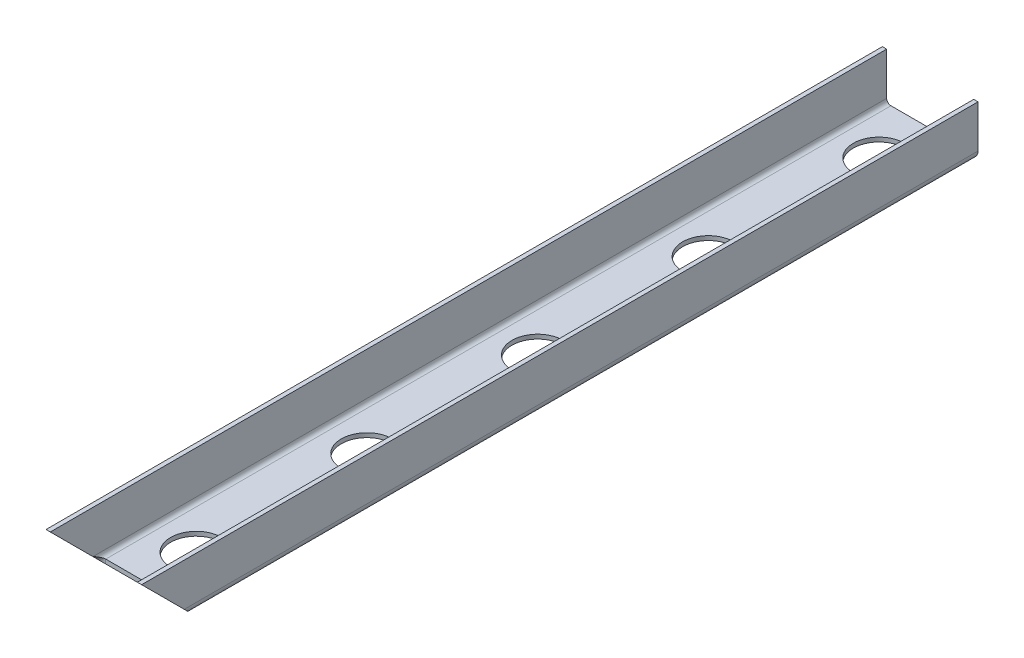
ISO-10303-21;
HEADER;
FILE_DESCRIPTION(('STEP AP214'),'2;1');
FILE_NAME('part.step','',(''),(''),'','','');
FILE_SCHEMA(('AUTOMOTIVE_DESIGN { 1 0 10303 214 1 1 1 1 }'));
ENDSEC;
DATA;
#1=APPLICATION_CONTEXT('core data for automotive mechanical design processes');
#2=APPLICATION_PROTOCOL_DEFINITION('international standard','automotive_design',2000,#1);
#3=PRODUCT_CONTEXT('',#1,'mechanical');
#4=PRODUCT('Part','Part','',(#3));
#5=PRODUCT_RELATED_PRODUCT_CATEGORY('part','',(#4));
#6=PRODUCT_DEFINITION_FORMATION('','',#4);
#7=PRODUCT_DEFINITION_CONTEXT('part definition',#1,'design');
#8=PRODUCT_DEFINITION('design','',#6,#7);
#9=PRODUCT_DEFINITION_SHAPE('','',#8);
#10=(LENGTH_UNIT() NAMED_UNIT(*) SI_UNIT(.MILLI.,.METRE.));
#11=(NAMED_UNIT(*) PLANE_ANGLE_UNIT() SI_UNIT($,.RADIAN.));
#12=(NAMED_UNIT(*) SI_UNIT($,.STERADIAN.) SOLID_ANGLE_UNIT());
#13=UNCERTAINTY_MEASURE_WITH_UNIT(LENGTH_MEASURE(1.E-05),#10,'distance_accuracy_value','');
#14=(GEOMETRIC_REPRESENTATION_CONTEXT(3) GLOBAL_UNCERTAINTY_ASSIGNED_CONTEXT((#13)) GLOBAL_UNIT_ASSIGNED_CONTEXT((#10,
#11,#12)) REPRESENTATION_CONTEXT('',''));
#15=CARTESIAN_POINT('',(0.,0.,0.));
#16=DIRECTION('',(0.,0.,1.));
#17=DIRECTION('',(1.,0.,0.));
#18=AXIS2_PLACEMENT_3D('',#15,#16,#17);
#19=CARTESIAN_POINT('',(28.,0.,245.));
#20=DIRECTION('',(-1.,0.,0.));
#21=DIRECTION('',(0.,0.,1.));
#22=AXIS2_PLACEMENT_3D('',#19,#20,#21);
#23=PLANE('',#22);
#24=DIRECTION('',(0.,-0.707106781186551,-0.707106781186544));
#25=VECTOR('',#24,1.);
#26=CARTESIAN_POINT('',(28.,13.7499999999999,231.25));
#27=LINE('',#26,#25);
#28=CARTESIAN_POINT('',(28.,27.5000000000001,245.));
#29=VERTEX_POINT('',#28);
#30=CARTESIAN_POINT('',(27.9999999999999,2.50000000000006,220.));
#31=VERTEX_POINT('',#30);
#32=EDGE_CURVE('E394',#29,#31,#27,.T.);
#33=ORIENTED_EDGE('',*,*,#32,.T.);
#34=DIRECTION('',(0.,0.,-1.));
#35=VECTOR('',#34,1.);
#36=CARTESIAN_POINT('',(28.,2.50000000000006,245.));
#37=LINE('',#36,#35);
#38=CARTESIAN_POINT('',(28.,2.50000000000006,-245.));
#39=VERTEX_POINT('',#38);
#40=EDGE_CURVE('E64',#31,#39,#37,.T.);
#41=ORIENTED_EDGE('',*,*,#40,.T.);
#42=DIRECTION('',(0.,1.,0.));
#43=VECTOR('',#42,1.);
#44=CARTESIAN_POINT('',(28.,0.,-245.));
#45=LINE('',#44,#43);
#46=CARTESIAN_POINT('',(28.,27.5,-245.));
#47=VERTEX_POINT('',#46);
#48=EDGE_CURVE('E388',#39,#47,#45,.T.);
#49=ORIENTED_EDGE('',*,*,#48,.T.);
#50=DIRECTION('',(0.,0.,-1.));
#51=VECTOR('',#50,1.);
#52=CARTESIAN_POINT('',(28.,27.5000000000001,245.));
#53=LINE('',#52,#51);
#54=EDGE_CURVE('E207',#29,#47,#53,.T.);
#55=ORIENTED_EDGE('',*,*,#54,.F.);
#56=EDGE_LOOP('',(#33,#41,#49,#55));
#57=FACE_BOUND('',#56,.T.);
#58=ADVANCED_FACE('F40',(#57),#23,.F.);
#59=CARTESIAN_POINT('',(25.5,0.,244.999999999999));
#60=DIRECTION('',(-1.,0.,0.));
#61=DIRECTION('',(0.,0.,1.));
#62=AXIS2_PLACEMENT_3D('',#59,#60,#61);
#63=PLANE('',#62);
#64=DIRECTION('',(0.,0.,-1.));
#65=VECTOR('',#64,1.);
#66=CARTESIAN_POINT('',(25.5,2.50000000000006,244.999999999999));
#67=LINE('',#66,#65);
#68=CARTESIAN_POINT('',(25.4999999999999,2.50000000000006,220.));
#69=VERTEX_POINT('',#68);
#70=CARTESIAN_POINT('',(25.5,2.50000000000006,-245.));
#71=VERTEX_POINT('',#70);
#72=EDGE_CURVE('E201',#69,#71,#67,.T.);
#73=ORIENTED_EDGE('',*,*,#72,.F.);
#74=DIRECTION('',(0.,-0.707106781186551,-0.707106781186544));
#75=VECTOR('',#74,1.);
#76=CARTESIAN_POINT('',(25.5,13.7499999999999,231.25));
#77=LINE('',#76,#75);
#78=CARTESIAN_POINT('',(25.5,27.5000000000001,244.999999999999));
#79=VERTEX_POINT('',#78);
#80=EDGE_CURVE('E397',#79,#69,#77,.T.);
#81=ORIENTED_EDGE('',*,*,#80,.F.);
#82=DIRECTION('',(0.,0.,-1.));
#83=VECTOR('',#82,1.);
#84=CARTESIAN_POINT('',(25.5,27.5000000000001,244.999999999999));
#85=LINE('',#84,#83);
#86=CARTESIAN_POINT('',(25.5,27.5,-245.));
#87=VERTEX_POINT('',#86);
#88=EDGE_CURVE('E204',#79,#87,#85,.T.);
#89=ORIENTED_EDGE('',*,*,#88,.T.);
#90=DIRECTION('',(0.,1.,0.));
#91=VECTOR('',#90,1.);
#92=CARTESIAN_POINT('',(25.5,0.,-245.));
#93=LINE('',#92,#91);
#94=EDGE_CURVE('E380',#71,#87,#93,.T.);
#95=ORIENTED_EDGE('',*,*,#94,.F.);
#96=EDGE_LOOP('',(#73,#81,#89,#95));
#97=FACE_BOUND('',#96,.T.);
#98=ADVANCED_FACE('F258',(#97),#63,.T.);
#99=CARTESIAN_POINT('',(23.,2.50000000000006,244.999999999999));
#100=DIRECTION('',(0.,0.,-1.));
#101=DIRECTION('',(-1.,0.,0.));
#102=AXIS2_PLACEMENT_3D('',#99,#100,#101);
#103=CYLINDRICAL_SURFACE('',#102,2.5);
#104=DIRECTION('',(0.,0.,-1.));
#105=VECTOR('',#104,1.);
#106=CARTESIAN_POINT('',(23.,0.,244.999999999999));
#107=LINE('',#106,#105);
#108=CARTESIAN_POINT('',(23.,0.,215.));
#109=VERTEX_POINT('',#108);
#110=CARTESIAN_POINT('',(23.,0.,-245.));
#111=VERTEX_POINT('',#110);
#112=EDGE_CURVE('E198',#109,#111,#107,.T.);
#113=ORIENTED_EDGE('',*,*,#112,.F.);
#114=CARTESIAN_POINT('',(22.9999999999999,2.50000000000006,220.));
#115=DIRECTION('',(0.,0.894427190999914,-0.447213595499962));
#116=DIRECTION('',(0.,-0.447213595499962,-0.894427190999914));
#117=AXIS2_PLACEMENT_3D('',#114,#115,#116);
#118=ELLIPSE('',#117,5.59016994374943,2.5);
#119=EDGE_CURVE('E139',#69,#109,#118,.T.);
#120=ORIENTED_EDGE('',*,*,#119,.F.);
#121=ORIENTED_EDGE('',*,*,#72,.T.);
#122=CARTESIAN_POINT('',(23.,2.50000000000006,-245.));
#123=DIRECTION('',(0.,0.,-1.));
#124=DIRECTION('',(-1.,0.,0.));
#125=AXIS2_PLACEMENT_3D('',#122,#123,#124);
#126=CIRCLE('',#125,2.5);
#127=EDGE_CURVE('E376',#111,#71,#126,.F.);
#128=ORIENTED_EDGE('',*,*,#127,.F.);
#129=EDGE_LOOP('',(#113,#120,#121,#128));
#130=FACE_BOUND('',#129,.T.);
#131=ADVANCED_FACE('F248',(#130),#103,.F.);
#132=CARTESIAN_POINT('',(-25.5,3.33066907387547E-13,245.));
#133=DIRECTION('',(0.,1.,0.));
#134=DIRECTION('',(-1.,0.,0.));
#135=AXIS2_PLACEMENT_3D('',#132,#133,#134);
#136=PLANE('',#135);
#137=CARTESIAN_POINT('',(0.,0.,-115.));
#138=DIRECTION('',(0.,1.,0.));
#139=DIRECTION('',(-1.,0.,0.));
#140=AXIS2_PLACEMENT_3D('',#137,#138,#139);
#141=CIRCLE('',#140,15.);
#142=CARTESIAN_POINT('',(-15.0000000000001,0.,-115.));
#143=VERTEX_POINT('',#142);
#144=EDGE_CURVE('E430',#143,#143,#141,.T.);
#145=ORIENTED_EDGE('',*,*,#144,.F.);
#146=EDGE_LOOP('',(#145));
#147=FACE_BOUND('',#146,.T.);
#148=CARTESIAN_POINT('',(0.,0.,-215.));
#149=DIRECTION('',(0.,1.,0.));
#150=DIRECTION('',(-1.,0.,0.));
#151=AXIS2_PLACEMENT_3D('',#148,#149,#150);
#152=CIRCLE('',#151,15.);
#153=CARTESIAN_POINT('',(-15.,0.,-215.));
#154=VERTEX_POINT('',#153);
#155=EDGE_CURVE('E423',#154,#154,#152,.T.);
#156=ORIENTED_EDGE('',*,*,#155,.F.);
#157=EDGE_LOOP('',(#156));
#158=FACE_BOUND('',#157,.T.);
#159=DIRECTION('',(0.,0.,-1.));
#160=VECTOR('',#159,1.);
#161=CARTESIAN_POINT('',(-23.,3.33066907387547E-13,245.));
#162=LINE('',#161,#160);
#163=CARTESIAN_POINT('',(-23.,3.33066907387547E-13,215.));
#164=VERTEX_POINT('',#163);
#165=CARTESIAN_POINT('',(-23.,3.33066907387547E-13,-245.));
#166=VERTEX_POINT('',#165);
#167=EDGE_CURVE('E195',#164,#166,#162,.T.);
#168=ORIENTED_EDGE('',*,*,#167,.F.);
#169=DIRECTION('',(-1.,0.,0.));
#170=VECTOR('',#169,1.);
#171=CARTESIAN_POINT('',(-25.5,3.33066907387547E-13,215.));
#172=LINE('',#171,#170);
#173=EDGE_CURVE('E144',#164,#109,#172,.F.);
#174=ORIENTED_EDGE('',*,*,#173,.T.);
#175=ORIENTED_EDGE('',*,*,#112,.T.);
#176=DIRECTION('',(1.,0.,0.));
#177=VECTOR('',#176,1.);
#178=CARTESIAN_POINT('',(-25.5,3.33066907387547E-13,-245.));
#179=LINE('',#178,#177);
#180=EDGE_CURVE('E372',#166,#111,#179,.T.);
#181=ORIENTED_EDGE('',*,*,#180,.F.);
#182=EDGE_LOOP('',(#168,#174,#175,#181));
#183=FACE_BOUND('',#182,.T.);
#184=CARTESIAN_POINT('',(0.,0.,-14.9999999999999));
#185=DIRECTION('',(0.,1.,0.));
#186=DIRECTION('',(-1.,0.,0.));
#187=AXIS2_PLACEMENT_3D('',#184,#185,#186);
#188=CIRCLE('',#187,15.);
#189=CARTESIAN_POINT('',(-15.,0.,-14.9999999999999));
#190=VERTEX_POINT('',#189);
#191=EDGE_CURVE('E224',#190,#190,#188,.T.);
#192=ORIENTED_EDGE('',*,*,#191,.F.);
#193=EDGE_LOOP('',(#192));
#194=FACE_BOUND('',#193,.T.);
#195=CARTESIAN_POINT('',(0.,0.,85.0000000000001));
#196=DIRECTION('',(0.,1.,0.));
#197=DIRECTION('',(-1.,0.,0.));
#198=AXIS2_PLACEMENT_3D('',#195,#196,#197);
#199=CIRCLE('',#198,15.);
#200=CARTESIAN_POINT('',(-15.,0.,85.0000000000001));
#201=VERTEX_POINT('',#200);
#202=EDGE_CURVE('E232',#201,#201,#199,.T.);
#203=ORIENTED_EDGE('',*,*,#202,.F.);
#204=EDGE_LOOP('',(#203));
#205=FACE_BOUND('',#204,.T.);
#206=CARTESIAN_POINT('',(0.,0.,185.));
#207=DIRECTION('',(0.,1.,0.));
#208=DIRECTION('',(-1.,0.,0.));
#209=AXIS2_PLACEMENT_3D('',#206,#207,#208);
#210=CIRCLE('',#209,15.);
#211=CARTESIAN_POINT('',(-15.,0.,185.));
#212=VERTEX_POINT('',#211);
#213=EDGE_CURVE('E49',#212,#212,#210,.T.);
#214=ORIENTED_EDGE('',*,*,#213,.F.);
#215=EDGE_LOOP('',(#214));
#216=FACE_BOUND('',#215,.T.);
#217=ADVANCED_FACE('F245',(#147,#158,#183,#194,#205,#216),#136,.T.);
#218=CARTESIAN_POINT('',(-23.,2.50000000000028,245.));
#219=DIRECTION('',(0.,0.,-1.));
#220=DIRECTION('',(-1.,0.,0.));
#221=AXIS2_PLACEMENT_3D('',#218,#219,#220);
#222=CYLINDRICAL_SURFACE('',#221,2.5);
#223=DIRECTION('',(0.,0.,-1.));
#224=VECTOR('',#223,1.);
#225=CARTESIAN_POINT('',(-25.5,2.50000000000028,245.));
#226=LINE('',#225,#224);
#227=CARTESIAN_POINT('',(-25.5,2.50000000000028,220.));
#228=VERTEX_POINT('',#227);
#229=CARTESIAN_POINT('',(-25.5,2.50000000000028,-245.));
#230=VERTEX_POINT('',#229);
#231=EDGE_CURVE('E192',#228,#230,#226,.T.);
#232=ORIENTED_EDGE('',*,*,#231,.F.);
#233=CARTESIAN_POINT('',(-23.,2.50000000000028,220.));
#234=DIRECTION('',(0.,0.894427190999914,-0.447213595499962));
#235=DIRECTION('',(0.,-0.447213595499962,-0.894427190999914));
#236=AXIS2_PLACEMENT_3D('',#233,#234,#235);
#237=ELLIPSE('',#236,5.59016994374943,2.5);
#238=EDGE_CURVE('E412',#164,#228,#237,.T.);
#239=ORIENTED_EDGE('',*,*,#238,.F.);
#240=ORIENTED_EDGE('',*,*,#167,.T.);
#241=CARTESIAN_POINT('',(-23.,2.50000000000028,-245.));
#242=DIRECTION('',(0.,0.,-1.));
#243=DIRECTION('',(-1.,0.,0.));
#244=AXIS2_PLACEMENT_3D('',#241,#242,#243);
#245=CIRCLE('',#244,2.5);
#246=EDGE_CURVE('E368',#230,#166,#245,.F.);
#247=ORIENTED_EDGE('',*,*,#246,.F.);
#248=EDGE_LOOP('',(#232,#239,#240,#247));
#249=FACE_BOUND('',#248,.T.);
#250=ADVANCED_FACE('F247',(#249),#222,.F.);
#251=CARTESIAN_POINT('',(-25.5,27.5000000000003,245.));
#252=DIRECTION('',(1.,0.,0.));
#253=DIRECTION('',(0.,1.,0.));
#254=AXIS2_PLACEMENT_3D('',#251,#252,#253);
#255=PLANE('',#254);
#256=DIRECTION('',(0.,0.,-1.));
#257=VECTOR('',#256,1.);
#258=CARTESIAN_POINT('',(-25.5,27.5000000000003,245.));
#259=LINE('',#258,#257);
#260=CARTESIAN_POINT('',(-25.5,27.5000000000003,245.));
#261=VERTEX_POINT('',#260);
#262=CARTESIAN_POINT('',(-25.5,27.5000000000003,-245.));
#263=VERTEX_POINT('',#262);
#264=EDGE_CURVE('E189',#261,#263,#259,.T.);
#265=ORIENTED_EDGE('',*,*,#264,.F.);
#266=DIRECTION('',(0.,0.707106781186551,0.707106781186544));
#267=VECTOR('',#266,1.);
#268=CARTESIAN_POINT('',(-25.5,-2.49999999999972,215.));
#269=LINE('',#268,#267);
#270=EDGE_CURVE('E56',#228,#261,#269,.T.);
#271=ORIENTED_EDGE('',*,*,#270,.F.);
#272=ORIENTED_EDGE('',*,*,#231,.T.);
#273=DIRECTION('',(0.,-1.,0.));
#274=VECTOR('',#273,1.);
#275=CARTESIAN_POINT('',(-25.5,27.5000000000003,-245.));
#276=LINE('',#275,#274);
#277=EDGE_CURVE('E337',#263,#230,#276,.T.);
#278=ORIENTED_EDGE('',*,*,#277,.F.);
#279=EDGE_LOOP('',(#265,#271,#272,#278));
#280=FACE_BOUND('',#279,.T.);
#281=ADVANCED_FACE('F255',(#280),#255,.T.);
#282=CARTESIAN_POINT('',(-28.,27.5000000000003,245.));
#283=DIRECTION('',(1.,0.,0.));
#284=DIRECTION('',(0.,1.,0.));
#285=AXIS2_PLACEMENT_3D('',#282,#283,#284);
#286=PLANE('',#285);
#287=DIRECTION('',(0.,0.707106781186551,0.707106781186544));
#288=VECTOR('',#287,1.);
#289=CARTESIAN_POINT('',(-28.,-2.49999999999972,215.));
#290=LINE('',#289,#288);
#291=CARTESIAN_POINT('',(-28.,2.50000000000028,220.));
#292=VERTEX_POINT('',#291);
#293=CARTESIAN_POINT('',(-28.,27.5000000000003,245.));
#294=VERTEX_POINT('',#293);
#295=EDGE_CURVE('E409',#292,#294,#290,.T.);
#296=ORIENTED_EDGE('',*,*,#295,.T.);
#297=DIRECTION('',(0.,0.,-1.));
#298=VECTOR('',#297,1.);
#299=CARTESIAN_POINT('',(-28.,27.5000000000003,245.));
#300=LINE('',#299,#298);
#301=CARTESIAN_POINT('',(-28.,27.5000000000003,-245.));
#302=VERTEX_POINT('',#301);
#303=EDGE_CURVE('E186',#294,#302,#300,.T.);
#304=ORIENTED_EDGE('',*,*,#303,.T.);
#305=DIRECTION('',(0.,-1.,0.));
#306=VECTOR('',#305,1.);
#307=CARTESIAN_POINT('',(-28.,27.5000000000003,-245.));
#308=LINE('',#307,#306);
#309=CARTESIAN_POINT('',(-28.,2.50000000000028,-245.));
#310=VERTEX_POINT('',#309);
#311=EDGE_CURVE('E359',#302,#310,#308,.T.);
#312=ORIENTED_EDGE('',*,*,#311,.T.);
#313=DIRECTION('',(0.,0.,-1.));
#314=VECTOR('',#313,1.);
#315=CARTESIAN_POINT('',(-28.,2.50000000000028,245.));
#316=LINE('',#315,#314);
#317=EDGE_CURVE('E177',#292,#310,#316,.T.);
#318=ORIENTED_EDGE('',*,*,#317,.F.);
#319=EDGE_LOOP('',(#296,#304,#312,#318));
#320=FACE_BOUND('',#319,.T.);
#321=ADVANCED_FACE('F314',(#320),#286,.F.);
#322=CARTESIAN_POINT('',(-23.,2.50000000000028,245.));
#323=DIRECTION('',(0.,0.,-1.));
#324=DIRECTION('',(-1.,0.,0.));
#325=AXIS2_PLACEMENT_3D('',#322,#323,#324);
#326=CYLINDRICAL_SURFACE('',#325,5.);
#327=CARTESIAN_POINT('',(-23.,2.50000000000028,220.));
#328=DIRECTION('',(0.,0.707106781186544,-0.707106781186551));
#329=DIRECTION('',(0.,-0.707106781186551,-0.707106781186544));
#330=AXIS2_PLACEMENT_3D('',#327,#328,#329);
#331=ELLIPSE('',#330,7.07106781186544,5.);
#332=CARTESIAN_POINT('',(-23.,-2.49999999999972,215.));
#333=VERTEX_POINT('',#332);
#334=EDGE_CURVE('E415',#333,#292,#331,.T.);
#335=ORIENTED_EDGE('',*,*,#334,.T.);
#336=ORIENTED_EDGE('',*,*,#317,.T.);
#337=CARTESIAN_POINT('',(-23.,2.50000000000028,-245.));
#338=DIRECTION('',(0.,0.,1.));
#339=DIRECTION('',(1.,0.,0.));
#340=AXIS2_PLACEMENT_3D('',#337,#338,#339);
#341=CIRCLE('',#340,5.);
#342=CARTESIAN_POINT('',(-23.,-2.49999999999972,-245.));
#343=VERTEX_POINT('',#342);
#344=EDGE_CURVE('E355',#310,#343,#341,.T.);
#345=ORIENTED_EDGE('',*,*,#344,.T.);
#346=DIRECTION('',(0.,0.,-1.));
#347=VECTOR('',#346,1.);
#348=CARTESIAN_POINT('',(-23.,-2.49999999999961,245.));
#349=LINE('',#348,#347);
#350=EDGE_CURVE('E172',#333,#343,#349,.T.);
#351=ORIENTED_EDGE('',*,*,#350,.F.);
#352=EDGE_LOOP('',(#335,#336,#345,#351));
#353=FACE_BOUND('',#352,.T.);
#354=ADVANCED_FACE('F305',(#353),#326,.T.);
#355=CARTESIAN_POINT('',(-25.5,-2.49999999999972,245.));
#356=DIRECTION('',(0.,1.,0.));
#357=DIRECTION('',(-1.,0.,0.));
#358=AXIS2_PLACEMENT_3D('',#355,#356,#357);
#359=PLANE('',#358);
#360=CARTESIAN_POINT('',(0.,-2.50000000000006,-115.));
#361=DIRECTION('',(0.,1.,0.));
#362=DIRECTION('',(-1.,0.,0.));
#363=AXIS2_PLACEMENT_3D('',#360,#361,#362);
#364=CIRCLE('',#363,15.);
#365=CARTESIAN_POINT('',(-15.,-2.50000000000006,-115.));
#366=VERTEX_POINT('',#365);
#367=EDGE_CURVE('E427',#366,#366,#364,.F.);
#368=ORIENTED_EDGE('',*,*,#367,.F.);
#369=EDGE_LOOP('',(#368));
#370=FACE_BOUND('',#369,.T.);
#371=CARTESIAN_POINT('',(0.,-2.49999999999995,-215.));
#372=DIRECTION('',(0.,1.,0.));
#373=DIRECTION('',(-1.,0.,0.));
#374=AXIS2_PLACEMENT_3D('',#371,#372,#373);
#375=CIRCLE('',#374,15.);
#376=CARTESIAN_POINT('',(-15.,-2.49999999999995,-215.));
#377=VERTEX_POINT('',#376);
#378=EDGE_CURVE('E163',#377,#377,#375,.F.);
#379=ORIENTED_EDGE('',*,*,#378,.F.);
#380=EDGE_LOOP('',(#379));
#381=FACE_BOUND('',#380,.T.);
#382=DIRECTION('',(1.,0.,0.));
#383=VECTOR('',#382,1.);
#384=CARTESIAN_POINT('',(-28.,-2.49999999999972,215.));
#385=LINE('',#384,#383);
#386=CARTESIAN_POINT('',(23.,-2.49999999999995,215.));
#387=VERTEX_POINT('',#386);
#388=EDGE_CURVE('E147',#333,#387,#385,.T.);
#389=ORIENTED_EDGE('',*,*,#388,.F.);
#390=ORIENTED_EDGE('',*,*,#350,.T.);
#391=DIRECTION('',(1.,0.,0.));
#392=VECTOR('',#391,1.);
#393=CARTESIAN_POINT('',(-25.5,-2.49999999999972,-245.));
#394=LINE('',#393,#392);
#395=CARTESIAN_POINT('',(23.,-2.49999999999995,-245.));
#396=VERTEX_POINT('',#395);
#397=EDGE_CURVE('E169',#343,#396,#394,.T.);
#398=ORIENTED_EDGE('',*,*,#397,.T.);
#399=DIRECTION('',(0.,0.,-1.));
#400=VECTOR('',#399,1.);
#401=CARTESIAN_POINT('',(23.,-2.49999999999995,244.999999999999));
#402=LINE('',#401,#400);
#403=EDGE_CURVE('E160',#387,#396,#402,.T.);
#404=ORIENTED_EDGE('',*,*,#403,.F.);
#405=EDGE_LOOP('',(#389,#390,#398,#404));
#406=FACE_BOUND('',#405,.T.);
#407=CARTESIAN_POINT('',(0.,-2.49999999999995,-14.9999999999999));
#408=DIRECTION('',(0.,1.,0.));
#409=DIRECTION('',(-1.,0.,0.));
#410=AXIS2_PLACEMENT_3D('',#407,#408,#409);
#411=CIRCLE('',#410,15.);
#412=CARTESIAN_POINT('',(-15.,-2.49999999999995,-14.9999999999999));
#413=VERTEX_POINT('',#412);
#414=EDGE_CURVE('E228',#413,#413,#411,.F.);
#415=ORIENTED_EDGE('',*,*,#414,.F.);
#416=EDGE_LOOP('',(#415));
#417=FACE_BOUND('',#416,.T.);
#418=CARTESIAN_POINT('',(0.,-2.49999999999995,85.0000000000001));
#419=DIRECTION('',(0.,1.,0.));
#420=DIRECTION('',(-1.,0.,0.));
#421=AXIS2_PLACEMENT_3D('',#418,#419,#420);
#422=CIRCLE('',#421,15.);
#423=CARTESIAN_POINT('',(-15.,-2.49999999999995,85.0000000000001));
#424=VERTEX_POINT('',#423);
#425=EDGE_CURVE('E236',#424,#424,#422,.F.);
#426=ORIENTED_EDGE('',*,*,#425,.F.);
#427=EDGE_LOOP('',(#426));
#428=FACE_BOUND('',#427,.T.);
#429=CARTESIAN_POINT('',(0.,-2.49999999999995,185.));
#430=DIRECTION('',(0.,1.,0.));
#431=DIRECTION('',(-1.,0.,0.));
#432=AXIS2_PLACEMENT_3D('',#429,#430,#431);
#433=CIRCLE('',#432,15.);
#434=CARTESIAN_POINT('',(-15.,-2.49999999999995,185.));
#435=VERTEX_POINT('',#434);
#436=EDGE_CURVE('E11',#435,#435,#433,.F.);
#437=ORIENTED_EDGE('',*,*,#436,.F.);
#438=EDGE_LOOP('',(#437));
#439=FACE_BOUND('',#438,.T.);
#440=ADVANCED_FACE('F166',(#370,#381,#406,#417,#428,#439),#359,.F.);
#441=CARTESIAN_POINT('',(23.,2.50000000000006,244.999999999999));
#442=DIRECTION('',(0.,0.,-1.));
#443=DIRECTION('',(-1.,0.,0.));
#444=AXIS2_PLACEMENT_3D('',#441,#442,#443);
#445=CYLINDRICAL_SURFACE('',#444,5.);
#446=CARTESIAN_POINT('',(22.9999999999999,2.50000000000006,220.));
#447=DIRECTION('',(0.,0.707106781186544,-0.707106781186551));
#448=DIRECTION('',(0.,-0.707106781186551,-0.707106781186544));
#449=AXIS2_PLACEMENT_3D('',#446,#447,#448);
#450=ELLIPSE('',#449,7.07106781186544,5.);
#451=EDGE_CURVE('E136',#31,#387,#450,.T.);
#452=ORIENTED_EDGE('',*,*,#451,.T.);
#453=ORIENTED_EDGE('',*,*,#403,.T.);
#454=CARTESIAN_POINT('',(23.,2.50000000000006,-245.));
#455=DIRECTION('',(0.,0.,1.));
#456=DIRECTION('',(1.,0.,0.));
#457=AXIS2_PLACEMENT_3D('',#454,#455,#456);
#458=CIRCLE('',#457,5.);
#459=EDGE_CURVE('E348',#396,#39,#458,.T.);
#460=ORIENTED_EDGE('',*,*,#459,.T.);
#461=ORIENTED_EDGE('',*,*,#40,.F.);
#462=EDGE_LOOP('',(#452,#453,#460,#461));
#463=FACE_BOUND('',#462,.T.);
#464=ADVANCED_FACE('F158',(#463),#445,.T.);
#465=CARTESIAN_POINT('',(-25.5,2.50000000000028,-245.));
#466=DIRECTION('',(0.,0.,-1.));
#467=DIRECTION('',(-1.,0.,0.));
#468=AXIS2_PLACEMENT_3D('',#465,#466,#467);
#469=PLANE('',#468);
#470=DIRECTION('',(-1.,0.,0.));
#471=VECTOR('',#470,1.);
#472=CARTESIAN_POINT('',(-25.5,2.50000000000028,-245.));
#473=LINE('',#472,#471);
#474=EDGE_CURVE('E221',#230,#310,#473,.T.);
#475=ORIENTED_EDGE('',*,*,#474,.F.);
#476=ORIENTED_EDGE('',*,*,#246,.T.);
#477=DIRECTION('',(0.,1.,0.));
#478=VECTOR('',#477,1.);
#479=CARTESIAN_POINT('',(-23.,-2.49999999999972,-245.));
#480=LINE('',#479,#478);
#481=EDGE_CURVE('E217',#343,#166,#480,.T.);
#482=ORIENTED_EDGE('',*,*,#481,.F.);
#483=ORIENTED_EDGE('',*,*,#344,.F.);
#484=EDGE_LOOP('',(#475,#476,#482,#483));
#485=FACE_BOUND('',#484,.T.);
#486=ADVANCED_FACE('F284',(#485),#469,.T.);
#487=CARTESIAN_POINT('',(-23.,-2.49999999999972,-245.));
#488=DIRECTION('',(0.,0.,-1.));
#489=DIRECTION('',(-1.,0.,0.));
#490=AXIS2_PLACEMENT_3D('',#487,#488,#489);
#491=PLANE('',#490);
#492=ORIENTED_EDGE('',*,*,#277,.T.);
#493=ORIENTED_EDGE('',*,*,#474,.T.);
#494=ORIENTED_EDGE('',*,*,#311,.F.);
#495=DIRECTION('',(1.,0.,0.));
#496=VECTOR('',#495,1.);
#497=CARTESIAN_POINT('',(-28.,27.5000000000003,-245.));
#498=LINE('',#497,#496);
#499=EDGE_CURVE('E363',#302,#263,#498,.T.);
#500=ORIENTED_EDGE('',*,*,#499,.T.);
#501=EDGE_LOOP('',(#492,#493,#494,#500));
#502=FACE_BOUND('',#501,.T.);
#503=ADVANCED_FACE('F280',(#502),#491,.T.);
#504=CARTESIAN_POINT('',(23.,0.,-245.));
#505=DIRECTION('',(0.,0.,-1.));
#506=DIRECTION('',(-1.,0.,0.));
#507=AXIS2_PLACEMENT_3D('',#504,#505,#506);
#508=PLANE('',#507);
#509=DIRECTION('',(0.,-1.,0.));
#510=VECTOR('',#509,1.);
#511=CARTESIAN_POINT('',(23.,0.,-245.));
#512=LINE('',#511,#510);
#513=EDGE_CURVE('E214',#111,#396,#512,.T.);
#514=ORIENTED_EDGE('',*,*,#513,.F.);
#515=ORIENTED_EDGE('',*,*,#127,.T.);
#516=DIRECTION('',(-1.,0.,0.));
#517=VECTOR('',#516,1.);
#518=CARTESIAN_POINT('',(28.,2.50000000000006,-245.));
#519=LINE('',#518,#517);
#520=EDGE_CURVE('E210',#39,#71,#519,.T.);
#521=ORIENTED_EDGE('',*,*,#520,.F.);
#522=ORIENTED_EDGE('',*,*,#459,.F.);
#523=EDGE_LOOP('',(#514,#515,#521,#522));
#524=FACE_BOUND('',#523,.T.);
#525=ADVANCED_FACE('F276',(#524),#508,.T.);
#526=CARTESIAN_POINT('',(28.,2.50000000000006,-245.));
#527=DIRECTION('',(0.,0.,-1.));
#528=DIRECTION('',(-1.,0.,0.));
#529=AXIS2_PLACEMENT_3D('',#526,#527,#528);
#530=PLANE('',#529);
#531=ORIENTED_EDGE('',*,*,#180,.T.);
#532=ORIENTED_EDGE('',*,*,#513,.T.);
#533=ORIENTED_EDGE('',*,*,#397,.F.);
#534=ORIENTED_EDGE('',*,*,#481,.T.);
#535=EDGE_LOOP('',(#531,#532,#533,#534));
#536=FACE_BOUND('',#535,.T.);
#537=ADVANCED_FACE('F273',(#536),#530,.T.);
#538=CARTESIAN_POINT('',(25.5,27.5000000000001,244.999999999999));
#539=DIRECTION('',(0.,1.,0.));
#540=DIRECTION('',(0.,0.,1.));
#541=AXIS2_PLACEMENT_3D('',#538,#539,#540);
#542=PLANE('',#541);
#543=DIRECTION('',(1.,0.,0.));
#544=VECTOR('',#543,1.);
#545=CARTESIAN_POINT('',(25.5,27.5,-245.));
#546=LINE('',#545,#544);
#547=EDGE_CURVE('E384',#87,#47,#546,.T.);
#548=ORIENTED_EDGE('',*,*,#547,.F.);
#549=ORIENTED_EDGE('',*,*,#88,.F.);
#550=DIRECTION('',(1.,0.,0.));
#551=VECTOR('',#550,1.);
#552=CARTESIAN_POINT('',(25.5,27.5000000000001,244.999999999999));
#553=LINE('',#552,#551);
#554=EDGE_CURVE('E344',#79,#29,#553,.T.);
#555=ORIENTED_EDGE('',*,*,#554,.T.);
#556=ORIENTED_EDGE('',*,*,#54,.T.);
#557=EDGE_LOOP('',(#548,#549,#555,#556));
#558=FACE_BOUND('',#557,.T.);
#559=ADVANCED_FACE('F272',(#558),#542,.T.);
#560=CARTESIAN_POINT('',(-28.,27.5000000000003,245.));
#561=DIRECTION('',(0.,1.,0.));
#562=DIRECTION('',(0.,0.,1.));
#563=AXIS2_PLACEMENT_3D('',#560,#561,#562);
#564=PLANE('',#563);
#565=ORIENTED_EDGE('',*,*,#499,.F.);
#566=ORIENTED_EDGE('',*,*,#303,.F.);
#567=DIRECTION('',(1.,0.,0.));
#568=VECTOR('',#567,1.);
#569=CARTESIAN_POINT('',(-28.,27.5000000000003,245.));
#570=LINE('',#569,#568);
#571=EDGE_CURVE('E180',#294,#261,#570,.T.);
#572=ORIENTED_EDGE('',*,*,#571,.T.);
#573=ORIENTED_EDGE('',*,*,#264,.T.);
#574=EDGE_LOOP('',(#565,#566,#572,#573));
#575=FACE_BOUND('',#574,.T.);
#576=ADVANCED_FACE('F324',(#575),#564,.T.);
#577=CARTESIAN_POINT('',(23.,2.50000000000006,-245.));
#578=DIRECTION('',(0.,0.,-1.));
#579=DIRECTION('',(-1.,0.,0.));
#580=AXIS2_PLACEMENT_3D('',#577,#578,#579);
#581=PLANE('',#580);
#582=ORIENTED_EDGE('',*,*,#48,.F.);
#583=ORIENTED_EDGE('',*,*,#520,.T.);
#584=ORIENTED_EDGE('',*,*,#94,.T.);
#585=ORIENTED_EDGE('',*,*,#547,.T.);
#586=EDGE_LOOP('',(#582,#583,#584,#585));
#587=FACE_BOUND('',#586,.T.);
#588=ADVANCED_FACE('F327',(#587),#581,.T.);
#589=CARTESIAN_POINT('',(25.5,13.7499999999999,231.25));
#590=DIRECTION('',(0.,0.707106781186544,-0.707106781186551));
#591=DIRECTION('',(0.,-0.707106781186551,-0.707106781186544));
#592=AXIS2_PLACEMENT_3D('',#589,#590,#591);
#593=PLANE('',#592);
#594=ORIENTED_EDGE('',*,*,#80,.T.);
#595=DIRECTION('',(-1.,0.,0.));
#596=VECTOR('',#595,1.);
#597=CARTESIAN_POINT('',(25.4999999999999,2.50000000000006,220.));
#598=LINE('',#597,#596);
#599=EDGE_CURVE('E391',#69,#31,#598,.F.);
#600=ORIENTED_EDGE('',*,*,#599,.T.);
#601=ORIENTED_EDGE('',*,*,#32,.F.);
#602=ORIENTED_EDGE('',*,*,#554,.F.);
#603=EDGE_LOOP('',(#594,#600,#601,#602));
#604=FACE_BOUND('',#603,.T.);
#605=ADVANCED_FACE('F469',(#604),#593,.F.);
#606=CARTESIAN_POINT('',(-28.,-2.49999999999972,215.));
#607=DIRECTION('',(0.,0.,1.));
#608=DIRECTION('',(1.,0.,0.));
#609=AXIS2_PLACEMENT_3D('',#606,#607,#608);
#610=PLANE('',#609);
#611=DIRECTION('',(0.,-1.,0.));
#612=VECTOR('',#611,1.);
#613=CARTESIAN_POINT('',(-23.,-2.49999999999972,215.));
#614=LINE('',#613,#612);
#615=EDGE_CURVE('E143',#333,#164,#614,.F.);
#616=ORIENTED_EDGE('',*,*,#615,.F.);
#617=ORIENTED_EDGE('',*,*,#388,.T.);
#618=DIRECTION('',(0.,-1.,0.));
#619=VECTOR('',#618,1.);
#620=CARTESIAN_POINT('',(23.,-2.49999999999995,215.));
#621=LINE('',#620,#619);
#622=EDGE_CURVE('E132',#387,#109,#621,.F.);
#623=ORIENTED_EDGE('',*,*,#622,.T.);
#624=ORIENTED_EDGE('',*,*,#173,.F.);
#625=EDGE_LOOP('',(#616,#617,#623,#624));
#626=FACE_BOUND('',#625,.T.);
#627=ADVANCED_FACE('F148',(#626),#610,.T.);
#628=CARTESIAN_POINT('',(-28.,-2.49999999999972,215.));
#629=DIRECTION('',(0.,0.707106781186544,-0.707106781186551));
#630=DIRECTION('',(0.,0.707106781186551,0.707106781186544));
#631=AXIS2_PLACEMENT_3D('',#628,#629,#630);
#632=PLANE('',#631);
#633=ORIENTED_EDGE('',*,*,#571,.F.);
#634=ORIENTED_EDGE('',*,*,#295,.F.);
#635=DIRECTION('',(-1.,0.,0.));
#636=VECTOR('',#635,1.);
#637=CARTESIAN_POINT('',(-28.,2.50000000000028,220.));
#638=LINE('',#637,#636);
#639=EDGE_CURVE('E155',#292,#228,#638,.F.);
#640=ORIENTED_EDGE('',*,*,#639,.T.);
#641=ORIENTED_EDGE('',*,*,#270,.T.);
#642=EDGE_LOOP('',(#633,#634,#640,#641));
#643=FACE_BOUND('',#642,.T.);
#644=ADVANCED_FACE('F458',(#643),#632,.F.);
#645=CARTESIAN_POINT('',(-23.,3.33066907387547E-13,215.));
#646=CARTESIAN_POINT('',(-23.,-0.83333333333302,215.));
#647=CARTESIAN_POINT('',(-23.,-1.66666666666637,215.));
#648=CARTESIAN_POINT('',(-23.,-2.49999999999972,215.));
#649=CARTESIAN_POINT('',(-27.9999999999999,2.4980018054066E-13,215.));
#650=CARTESIAN_POINT('',(-29.6666666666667,-0.833333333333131,215.));
#651=CARTESIAN_POINT('',(-31.3333333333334,-1.66666666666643,215.));
#652=CARTESIAN_POINT('',(-33.,-2.49999999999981,215.));
#653=CARTESIAN_POINT('',(-28.,5.0000000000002,225.));
#654=CARTESIAN_POINT('',(-29.6666666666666,5.83333333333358,225.));
#655=CARTESIAN_POINT('',(-31.3333333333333,6.66666666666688,225.));
#656=CARTESIAN_POINT('',(-33.,7.50000000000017,225.));
#657=CARTESIAN_POINT('',(-23.,5.00000000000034,225.));
#658=CARTESIAN_POINT('',(-23.,5.83333333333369,225.));
#659=CARTESIAN_POINT('',(-23.,6.66666666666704,225.));
#660=CARTESIAN_POINT('',(-23.,7.50000000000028,225.));
#661=CARTESIAN_POINT('',(-18.,5.00000000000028,225.));
#662=CARTESIAN_POINT('',(-16.3333333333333,5.83333333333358,225.));
#663=CARTESIAN_POINT('',(-14.6666666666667,6.66666666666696,225.));
#664=CARTESIAN_POINT('',(-13.,7.50000000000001,225.));
#665=CARTESIAN_POINT('',(-17.9999999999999,2.4980018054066E-13,215.));
#666=CARTESIAN_POINT('',(-16.3333333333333,-0.833333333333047,215.));
#667=CARTESIAN_POINT('',(-14.6666666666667,-1.66666666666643,215.));
#668=CARTESIAN_POINT('',(-13.,-2.49999999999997,215.));
#669=CARTESIAN_POINT('',(-23.,3.33066907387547E-13,215.));
#670=CARTESIAN_POINT('',(-23.,-0.83333333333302,215.));
#671=CARTESIAN_POINT('',(-23.,-1.66666666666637,215.));
#672=CARTESIAN_POINT('',(-23.,-2.49999999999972,215.));
#673=(BOUNDED_SURFACE() B_SPLINE_SURFACE(3,3,((#645,#646,#647,#648),(#649,#650,#651,#652),(#653,
#654,#655,#656),(#657,#658,#659,#660),(#661,#662,#663,#664),(#665,#666,#667,#668),(#669,#670,
#671,#672)),.UNSPECIFIED.,.T.,.F.,.F.) B_SPLINE_SURFACE_WITH_KNOTS((4,3,4),(4,4),(0.,0.5,1.),
(0.,1.),.UNSPECIFIED.) GEOMETRIC_REPRESENTATION_ITEM() RATIONAL_B_SPLINE_SURFACE(((1.,1.,1.,1.),
(0.333333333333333,0.333333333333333,0.333333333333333,0.333333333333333),(0.333333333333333,
0.333333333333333,0.333333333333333,0.333333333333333),(1.,1.,1.,1.),(0.333333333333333,
0.333333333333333,0.333333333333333,0.333333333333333),(0.333333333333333,0.333333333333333,
0.333333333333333,0.333333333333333),(1.,1.,1.,1.))) REPRESENTATION_ITEM('') SURFACE());
#674=ORIENTED_EDGE('',*,*,#639,.F.);
#675=ORIENTED_EDGE('',*,*,#334,.F.);
#676=ORIENTED_EDGE('',*,*,#615,.T.);
#677=ORIENTED_EDGE('',*,*,#238,.T.);
#678=EDGE_LOOP('',(#674,#675,#676,#677));
#679=FACE_BOUND('',#678,.T.);
#680=ADVANCED_FACE('F448',(#679),#673,.T.);
#681=CARTESIAN_POINT('',(23.,0.,215.));
#682=CARTESIAN_POINT('',(23.,-0.833333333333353,215.));
#683=CARTESIAN_POINT('',(23.,-1.66666666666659,215.));
#684=CARTESIAN_POINT('',(23.,-2.49999999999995,215.));
#685=CARTESIAN_POINT('',(18.0000000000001,0.,215.));
#686=CARTESIAN_POINT('',(16.3333333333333,-0.833333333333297,215.));
#687=CARTESIAN_POINT('',(14.6666666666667,-1.66666666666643,215.));
#688=CARTESIAN_POINT('',(13.,-2.49999999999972,215.));
#689=CARTESIAN_POINT('',(18.0000000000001,5.00000000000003,225.));
#690=CARTESIAN_POINT('',(16.3333333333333,5.83333333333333,225.));
#691=CARTESIAN_POINT('',(14.6666666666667,6.66666666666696,225.));
#692=CARTESIAN_POINT('',(13.,7.50000000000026,225.));
#693=CARTESIAN_POINT('',(22.9999999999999,5.,225.));
#694=CARTESIAN_POINT('',(22.9999999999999,5.83333333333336,225.));
#695=CARTESIAN_POINT('',(22.9999999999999,6.66666666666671,225.));
#696=CARTESIAN_POINT('',(23.,7.50000000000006,225.));
#697=CARTESIAN_POINT('',(28.,5.0000000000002,225.));
#698=CARTESIAN_POINT('',(29.6666666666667,5.83333333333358,225.));
#699=CARTESIAN_POINT('',(31.3333333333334,6.66666666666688,225.));
#700=CARTESIAN_POINT('',(33.,7.50000000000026,225.));
#701=CARTESIAN_POINT('',(28.0000000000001,2.4980018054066E-13,215.));
#702=CARTESIAN_POINT('',(29.6666666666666,-0.833333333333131,215.));
#703=CARTESIAN_POINT('',(31.3333333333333,-1.66666666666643,215.));
#704=CARTESIAN_POINT('',(33.,-2.49999999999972,215.));
#705=CARTESIAN_POINT('',(23.,0.,215.));
#706=CARTESIAN_POINT('',(23.,-0.833333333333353,215.));
#707=CARTESIAN_POINT('',(23.,-1.66666666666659,215.));
#708=CARTESIAN_POINT('',(23.,-2.49999999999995,215.));
#709=(BOUNDED_SURFACE() B_SPLINE_SURFACE(3,3,((#681,#682,#683,#684),(#685,#686,#687,#688),(#689,
#690,#691,#692),(#693,#694,#695,#696),(#697,#698,#699,#700),(#701,#702,#703,#704),(#705,#706,
#707,#708)),.UNSPECIFIED.,.T.,.F.,.F.) B_SPLINE_SURFACE_WITH_KNOTS((4,3,4),(4,4),(0.,0.5,1.),
(0.,1.),.UNSPECIFIED.) GEOMETRIC_REPRESENTATION_ITEM() RATIONAL_B_SPLINE_SURFACE(((1.,1.,1.,1.),
(0.333333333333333,0.333333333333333,0.333333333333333,0.333333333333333),(0.333333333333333,
0.333333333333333,0.333333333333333,0.333333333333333),(1.,1.,1.,1.),(0.333333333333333,
0.333333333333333,0.333333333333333,0.333333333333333),(0.333333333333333,0.333333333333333,
0.333333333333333,0.333333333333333),(1.,1.,1.,1.))) REPRESENTATION_ITEM('') SURFACE());
#710=ORIENTED_EDGE('',*,*,#622,.F.);
#711=ORIENTED_EDGE('',*,*,#451,.F.);
#712=ORIENTED_EDGE('',*,*,#599,.F.);
#713=ORIENTED_EDGE('',*,*,#119,.T.);
#714=EDGE_LOOP('',(#710,#711,#712,#713));
#715=FACE_BOUND('',#714,.T.);
#716=ADVANCED_FACE('F134',(#715),#709,.T.);
#717=CARTESIAN_POINT('',(0.,-2.50099999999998,-215.));
#718=DIRECTION('',(0.,1.,0.));
#719=DIRECTION('',(-1.,0.,0.));
#720=AXIS2_PLACEMENT_3D('',#717,#718,#719);
#721=CYLINDRICAL_SURFACE('',#720,15.);
#722=ORIENTED_EDGE('',*,*,#155,.T.);
#723=EDGE_LOOP('',(#722));
#724=FACE_BOUND('',#723,.T.);
#725=ORIENTED_EDGE('',*,*,#378,.T.);
#726=EDGE_LOOP('',(#725));
#727=FACE_BOUND('',#726,.T.);
#728=ADVANCED_FACE('F436',(#724,#727),#721,.F.);
#729=CARTESIAN_POINT('',(0.,-2.50100000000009,-115.));
#730=DIRECTION('',(0.,1.,0.));
#731=DIRECTION('',(-1.,0.,0.));
#732=AXIS2_PLACEMENT_3D('',#729,#730,#731);
#733=CYLINDRICAL_SURFACE('',#732,15.);
#734=ORIENTED_EDGE('',*,*,#144,.T.);
#735=EDGE_LOOP('',(#734));
#736=FACE_BOUND('',#735,.T.);
#737=ORIENTED_EDGE('',*,*,#367,.T.);
#738=EDGE_LOOP('',(#737));
#739=FACE_BOUND('',#738,.T.);
#740=ADVANCED_FACE('F292',(#736,#739),#733,.F.);
#741=CARTESIAN_POINT('',(0.,-2.50099999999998,-14.9999999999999));
#742=DIRECTION('',(0.,1.,0.));
#743=DIRECTION('',(-1.,0.,0.));
#744=AXIS2_PLACEMENT_3D('',#741,#742,#743);
#745=CYLINDRICAL_SURFACE('',#744,15.);
#746=ORIENTED_EDGE('',*,*,#191,.T.);
#747=EDGE_LOOP('',(#746));
#748=FACE_BOUND('',#747,.T.);
#749=ORIENTED_EDGE('',*,*,#414,.T.);
#750=EDGE_LOOP('',(#749));
#751=FACE_BOUND('',#750,.T.);
#752=ADVANCED_FACE('F289',(#748,#751),#745,.F.);
#753=CARTESIAN_POINT('',(0.,-2.50099999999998,85.0000000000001));
#754=DIRECTION('',(0.,1.,0.));
#755=DIRECTION('',(-1.,0.,0.));
#756=AXIS2_PLACEMENT_3D('',#753,#754,#755);
#757=CYLINDRICAL_SURFACE('',#756,15.);
#758=ORIENTED_EDGE('',*,*,#202,.T.);
#759=EDGE_LOOP('',(#758));
#760=FACE_BOUND('',#759,.T.);
#761=ORIENTED_EDGE('',*,*,#425,.T.);
#762=EDGE_LOOP('',(#761));
#763=FACE_BOUND('',#762,.T.);
#764=ADVANCED_FACE('F291',(#760,#763),#757,.F.);
#765=CARTESIAN_POINT('',(0.,-2.50099999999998,185.));
#766=DIRECTION('',(0.,1.,0.));
#767=DIRECTION('',(-1.,0.,0.));
#768=AXIS2_PLACEMENT_3D('',#765,#766,#767);
#769=CYLINDRICAL_SURFACE('',#768,15.);
#770=ORIENTED_EDGE('',*,*,#213,.T.);
#771=EDGE_LOOP('',(#770));
#772=FACE_BOUND('',#771,.T.);
#773=ORIENTED_EDGE('',*,*,#436,.T.);
#774=EDGE_LOOP('',(#773));
#775=FACE_BOUND('',#774,.T.);
#776=ADVANCED_FACE('F42',(#772,#775),#769,.F.);
#777=CLOSED_SHELL('',(#58,#98,#131,#217,#250,#281,#321,#354,#440,#464,#486,#503,#525,#537,#559,
#576,#588,#605,#627,#644,#680,#716,#728,#740,#752,#764,#776));
#778=MANIFOLD_SOLID_BREP('B2',#777);
#779=ADVANCED_BREP_SHAPE_REPRESENTATION('',(#18,#778),#14);
#780=SHAPE_DEFINITION_REPRESENTATION(#9,#779);
ENDSEC;
END-ISO-10303-21;
